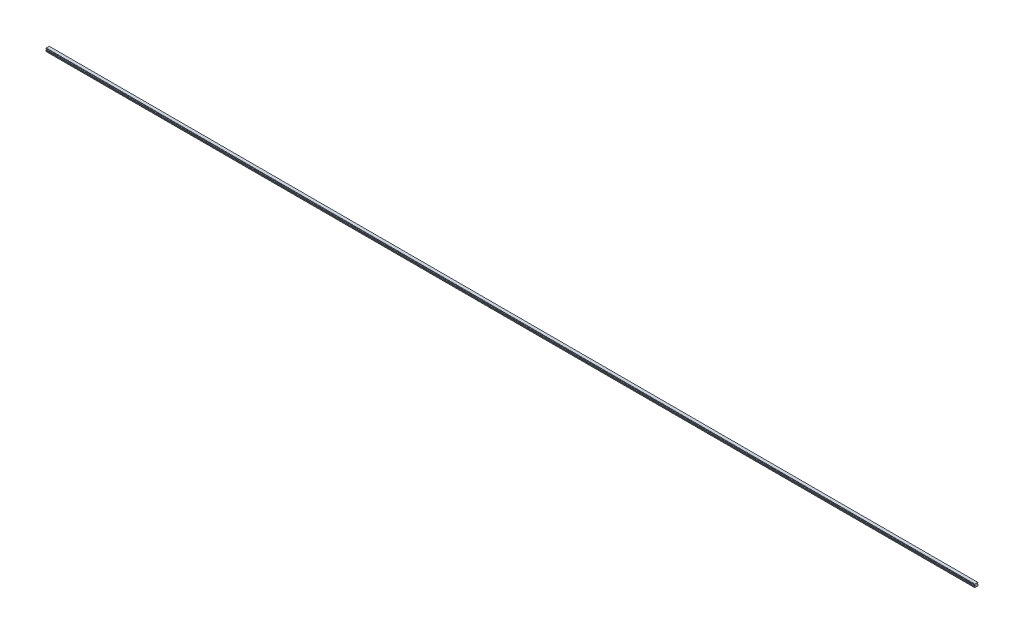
from build123d import *

# Parameters (mm, degrees)
BOSS_EXTRUDE1_DEPTH        = 4020
SKETCH3_R                  = 2.5
SKETCH3_R_2                = 2.1
CUT_EXTRUDE3_DEPTH         = 7
SKETCH3_2_R                = 2.1
CUT_EXTRUDE4_DEPTH         = 9.5
CHAMFER1_SIZE              = 0.4
LPATTERN2_COUNT            = 67
LPATTERN2_PITCH            = 60
CHAMFER1_OF_LPATTERN2_SIZE = 0.4


with BuildPart() as part:
    # Sketch1 → Boss-Extrude1 (new body)
    with BuildSketch(Plane(origin=(0, 0, 0), x_dir=(0, 0, -1), z_dir=(1, 0, 0))):
        with BuildLine():
            Line((6.59, 14), (-6.59, 14))
            Line((-6.59, 14), (-6.59, 13.15))
            Line((-6.59, 13.15), (-6.96, 12.356532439))
            Line((-6.96, 12.356532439), (-6.96, 11.435174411))
            ThreePointArc((-6.96, 11.435174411), (-5.25, 9.5), (-6.96, 7.564825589))
            Line((-6.96, 7.564825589), (-6.96, 6.643467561))
            Line((-6.96, 6.643467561), (-6.59, 5.85))
            Line((-6.59, 5.85), (-7.032116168, 4.2))
            Line((-7.032116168, 4.2), (-7.5, 3.929867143))
            Line((-7.5, 3.929867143), (-7.5, 1.4))
            Line((-7.5, 1.4), (-6.1, 0))
            Line((-6.1, 0), (-3.65, 0))
            Line((-3.65, 0), (-3.25, 0.4))
            Line((-3.25, 0.4), (3.25, 0.4))
            Line((3.25, 0.4), (3.65, 0))
            Line((3.65, 0), (6.1, 0))
            Line((6.1, 0), (7.5, 1.4))
            Line((7.5, 1.4), (7.5, 3.929867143))
            Line((7.5, 3.929867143), (7.032116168, 4.2))
            Line((7.032116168, 4.2), (6.59, 5.85))
            Line((6.59, 5.85), (6.96, 6.643467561))
            Line((6.96, 6.643467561), (6.96, 7.564825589))
            ThreePointArc((6.96, 7.564825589), (5.25, 9.5), (6.96, 11.435174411))
            Line((6.96, 11.435174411), (6.96, 12.356532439))
            Line((6.96, 12.356532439), (6.59, 13.15))
            Line((6.59, 13.15), (6.59, 14))
        make_face()
    extrude(amount=BOSS_EXTRUDE1_DEPTH)

    # Sketch3 → Cut-Extrude3 (cut)
    with BuildSketch(Plane.XZ):
        with Locations(Location((30, 0, 0), (0, 0, 270))):
            Circle(SKETCH3_R)
        with Locations(Location((30, 0, 0), (0, 0, 270))):
            Circle(SKETCH3_R_2, mode=Mode.SUBTRACT)
    cut_extrude3 = extrude(amount=-CUT_EXTRUDE3_DEPTH, mode=Mode.SUBTRACT)

    # Sketch3_2 → Cut-Extrude4 (cut)
    with BuildSketch(Plane.XZ):
        with Locations(Location((30, 0, 0), (0, 0, 270))):
            Circle(SKETCH3_2_R)
    cut_extrude4 = extrude(amount=-CUT_EXTRUDE4_DEPTH, mode=Mode.SUBTRACT)

    # Cut-Extrude5 cone 1 section (on through the dimple's axis) → Cut-Extrude5 (revolve, cut)
    with BuildSketch(Plane(origin=(30, 9.5, 0), x_dir=(0, 0, -1), z_dir=(1, 0, 0))):
        Polygon((0, 0), (2.1, 0), (0, 1.212435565), align=None)
    revolve(axis=Axis((30, 9.5, 0), (0, 1, 0)), mode=Mode.SUBTRACT)

    # Chamfer1
    chamfer1_edges = [part.edges().sort_by_distance(p)[0] for p in [
        (30, 0.4, 2.5),
    ]]
    chamfer(chamfer1_edges, length=CHAMFER1_SIZE)

    # LPattern2: Cut-Extrude3, Cut-Extrude4 ×67
    with Locations(*[(i * LPATTERN2_PITCH, 0, 0) for i in range(1, LPATTERN2_COUNT)]):
        add(cut_extrude3, mode=Mode.SUBTRACT)
        add(cut_extrude4, mode=Mode.SUBTRACT)

    # Chamfer1 of LPattern2
    chamfer1_of_lpattern2_edges = [part.edges().sort_by_distance(p)[0] for p in [
        (90, 0.4, 2.5),
        (150, 0.4, 2.5),
        (210, 0.4, 2.5),
        (270, 0.4, 2.5),
        (330, 0.4, 2.5),
        (390, 0.4, 2.5),
        (450, 0.4, 2.5),
        (510, 0.4, 2.5),
        (570, 0.4, 2.5),
        (630, 0.4, 2.5),
        (690, 0.4, 2.5),
        (750, 0.4, 2.5),
        (810, 0.4, 2.5),
        (870, 0.4, 2.5),
        (930, 0.4, 2.5),
        (990, 0.4, 2.5),
        (1050, 0.4, 2.5),
        (1110, 0.4, 2.5),
        (1170, 0.4, 2.5),
        (1230, 0.4, 2.5),
        (1290, 0.4, 2.5),
        (1350, 0.4, 2.5),
        (1410, 0.4, 2.5),
        (1470, 0.4, 2.5),
        (1530, 0.4, 2.5),
        (1590, 0.4, 2.5),
        (1650, 0.4, 2.5),
        (1710, 0.4, 2.5),
        (1770, 0.4, 2.5),
        (1830, 0.4, 2.5),
        (1890, 0.4, 2.5),
        (1950, 0.4, 2.5),
        (2010, 0.4, 2.5),
        (2070, 0.4, 2.5),
        (2130, 0.4, 2.5),
        (2190, 0.4, 2.5),
        (2250, 0.4, 2.5),
        (2310, 0.4, 2.5),
        (2370, 0.4, 2.5),
        (2430, 0.4, 2.5),
        (2490, 0.4, 2.5),
        (2550, 0.4, 2.5),
        (2610, 0.4, 2.5),
        (2670, 0.4, 2.5),
        (2730, 0.4, 2.5),
        (2790, 0.4, 2.5),
        (2850, 0.4, 2.5),
        (2910, 0.4, 2.5),
        (2970, 0.4, 2.5),
        (3030, 0.4, 2.5),
        (3090, 0.4, 2.5),
        (3150, 0.4, 2.5),
        (3210, 0.4, 2.5),
        (3270, 0.4, 2.5),
        (3330, 0.4, 2.5),
        (3390, 0.4, 2.5),
        (3450, 0.4, 2.5),
        (3510, 0.4, 2.5),
        (3570, 0.4, 2.5),
        (3630, 0.4, 2.5),
        (3690, 0.4, 2.5),
        (3750, 0.4, 2.5),
        (3810, 0.4, 2.5),
        (3870, 0.4, 2.5),
        (3930, 0.4, 2.5),
        (3990, 0.4, 2.5),
    ]]
    chamfer(chamfer1_of_lpattern2_edges, length=CHAMFER1_OF_LPATTERN2_SIZE)


solid = part.part
